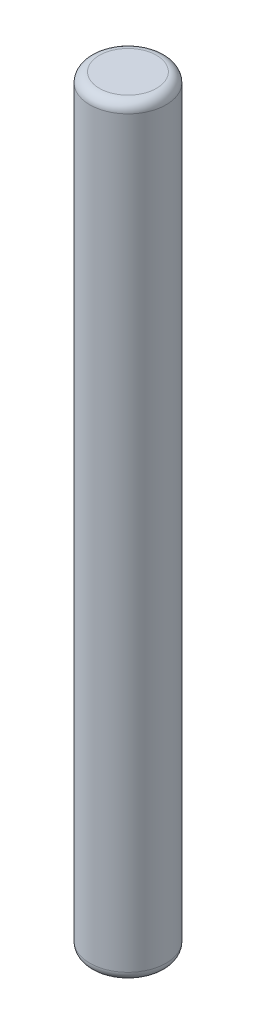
ISO-10303-21;
HEADER;
FILE_DESCRIPTION(('STEP AP214'),'2;1');
FILE_NAME('part.step','',(''),(''),'','','');
FILE_SCHEMA(('AUTOMOTIVE_DESIGN { 1 0 10303 214 1 1 1 1 }'));
ENDSEC;
DATA;
#1=APPLICATION_CONTEXT('core data for automotive mechanical design processes');
#2=APPLICATION_PROTOCOL_DEFINITION('international standard','automotive_design',2000,#1);
#3=PRODUCT_CONTEXT('',#1,'mechanical');
#4=PRODUCT('Part','Part','',(#3));
#5=PRODUCT_RELATED_PRODUCT_CATEGORY('part','',(#4));
#6=PRODUCT_DEFINITION_FORMATION('','',#4);
#7=PRODUCT_DEFINITION_CONTEXT('part definition',#1,'design');
#8=PRODUCT_DEFINITION('design','',#6,#7);
#9=PRODUCT_DEFINITION_SHAPE('','',#8);
#10=(LENGTH_UNIT() NAMED_UNIT(*) SI_UNIT(.MILLI.,.METRE.));
#11=(NAMED_UNIT(*) PLANE_ANGLE_UNIT() SI_UNIT($,.RADIAN.));
#12=(NAMED_UNIT(*) SI_UNIT($,.STERADIAN.) SOLID_ANGLE_UNIT());
#13=UNCERTAINTY_MEASURE_WITH_UNIT(LENGTH_MEASURE(1.E-05),#10,'distance_accuracy_value','');
#14=(GEOMETRIC_REPRESENTATION_CONTEXT(3) GLOBAL_UNCERTAINTY_ASSIGNED_CONTEXT((#13)) GLOBAL_UNIT_ASSIGNED_CONTEXT((#10,
#11,#12)) REPRESENTATION_CONTEXT('',''));
#15=CARTESIAN_POINT('',(0.,0.,0.));
#16=DIRECTION('',(0.,0.,1.));
#17=DIRECTION('',(1.,0.,0.));
#18=AXIS2_PLACEMENT_3D('',#15,#16,#17);
#19=CARTESIAN_POINT('',(0.,10.,0.));
#20=DIRECTION('',(0.,-1.,0.));
#21=DIRECTION('',(0.,0.,-1.));
#22=AXIS2_PLACEMENT_3D('',#19,#20,#21);
#23=CYLINDRICAL_SURFACE('',#22,1.);
#24=CARTESIAN_POINT('',(0.,-9.75,0.));
#25=DIRECTION('',(0.,1.,0.));
#26=DIRECTION('',(0.,0.,1.));
#27=AXIS2_PLACEMENT_3D('',#24,#25,#26);
#28=CIRCLE('',#27,1.);
#29=CARTESIAN_POINT('',(0.,-9.75,1.));
#30=VERTEX_POINT('',#29);
#31=EDGE_CURVE('E40',#30,#30,#28,.T.);
#32=ORIENTED_EDGE('',*,*,#31,.T.);
#33=EDGE_LOOP('',(#32));
#34=FACE_BOUND('',#33,.T.);
#35=CARTESIAN_POINT('',(0.,9.75,0.));
#36=DIRECTION('',(0.,1.,0.));
#37=DIRECTION('',(0.,0.,1.));
#38=AXIS2_PLACEMENT_3D('',#35,#36,#37);
#39=CIRCLE('',#38,1.);
#40=CARTESIAN_POINT('',(0.,9.75,1.));
#41=VERTEX_POINT('',#40);
#42=EDGE_CURVE('E44',#41,#41,#39,.F.);
#43=ORIENTED_EDGE('',*,*,#42,.T.);
#44=EDGE_LOOP('',(#43));
#45=FACE_BOUND('',#44,.T.);
#46=ADVANCED_FACE('F29',(#34,#45),#23,.T.);
#47=CARTESIAN_POINT('',(0.,10.,0.));
#48=DIRECTION('',(0.,1.,0.));
#49=DIRECTION('',(0.,0.,1.));
#50=AXIS2_PLACEMENT_3D('',#47,#48,#49);
#51=PLANE('',#50);
#52=CARTESIAN_POINT('',(0.,10.,0.));
#53=DIRECTION('',(0.,1.,0.));
#54=DIRECTION('',(0.,0.,1.));
#55=AXIS2_PLACEMENT_3D('',#52,#53,#54);
#56=CIRCLE('',#55,0.75);
#57=CARTESIAN_POINT('',(0.,10.,0.75));
#58=VERTEX_POINT('',#57);
#59=EDGE_CURVE('E10',#58,#58,#56,.T.);
#60=ORIENTED_EDGE('',*,*,#59,.T.);
#61=EDGE_LOOP('',(#60));
#62=FACE_BOUND('',#61,.T.);
#63=ADVANCED_FACE('F60',(#62),#51,.T.);
#64=CARTESIAN_POINT('',(0.,-10.,0.));
#65=DIRECTION('',(0.,1.,0.));
#66=DIRECTION('',(0.,0.,1.));
#67=AXIS2_PLACEMENT_3D('',#64,#65,#66);
#68=PLANE('',#67);
#69=CARTESIAN_POINT('',(0.,-10.,0.));
#70=DIRECTION('',(0.,1.,0.));
#71=DIRECTION('',(0.,0.,1.));
#72=AXIS2_PLACEMENT_3D('',#69,#70,#71);
#73=CIRCLE('',#72,0.75);
#74=CARTESIAN_POINT('',(0.,-10.,0.75));
#75=VERTEX_POINT('',#74);
#76=EDGE_CURVE('E36',#75,#75,#73,.F.);
#77=ORIENTED_EDGE('',*,*,#76,.T.);
#78=EDGE_LOOP('',(#77));
#79=FACE_BOUND('',#78,.T.);
#80=ADVANCED_FACE('F57',(#79),#68,.F.);
#81=CARTESIAN_POINT('',(0.,-9.75,0.));
#82=DIRECTION('',(0.,1.,0.));
#83=DIRECTION('',(0.,0.,1.));
#84=AXIS2_PLACEMENT_3D('',#81,#82,#83);
#85=TOROIDAL_SURFACE('',#84,0.75,0.25);
#86=ORIENTED_EDGE('',*,*,#76,.F.);
#87=EDGE_LOOP('',(#86));
#88=FACE_BOUND('',#87,.T.);
#89=ORIENTED_EDGE('',*,*,#31,.F.);
#90=EDGE_LOOP('',(#89));
#91=FACE_BOUND('',#90,.T.);
#92=ADVANCED_FACE('F53',(#88,#91),#85,.T.);
#93=CARTESIAN_POINT('',(0.,9.75,0.));
#94=DIRECTION('',(0.,1.,0.));
#95=DIRECTION('',(0.,0.,1.));
#96=AXIS2_PLACEMENT_3D('',#93,#94,#95);
#97=TOROIDAL_SURFACE('',#96,0.75,0.25);
#98=ORIENTED_EDGE('',*,*,#42,.F.);
#99=EDGE_LOOP('',(#98));
#100=FACE_BOUND('',#99,.T.);
#101=ORIENTED_EDGE('',*,*,#59,.F.);
#102=EDGE_LOOP('',(#101));
#103=FACE_BOUND('',#102,.T.);
#104=ADVANCED_FACE('F31',(#100,#103),#97,.T.);
#105=CLOSED_SHELL('',(#46,#63,#80,#92,#104));
#106=MANIFOLD_SOLID_BREP('B2',#105);
#107=ADVANCED_BREP_SHAPE_REPRESENTATION('',(#18,#106),#14);
#108=SHAPE_DEFINITION_REPRESENTATION(#9,#107);
ENDSEC;
END-ISO-10303-21;
